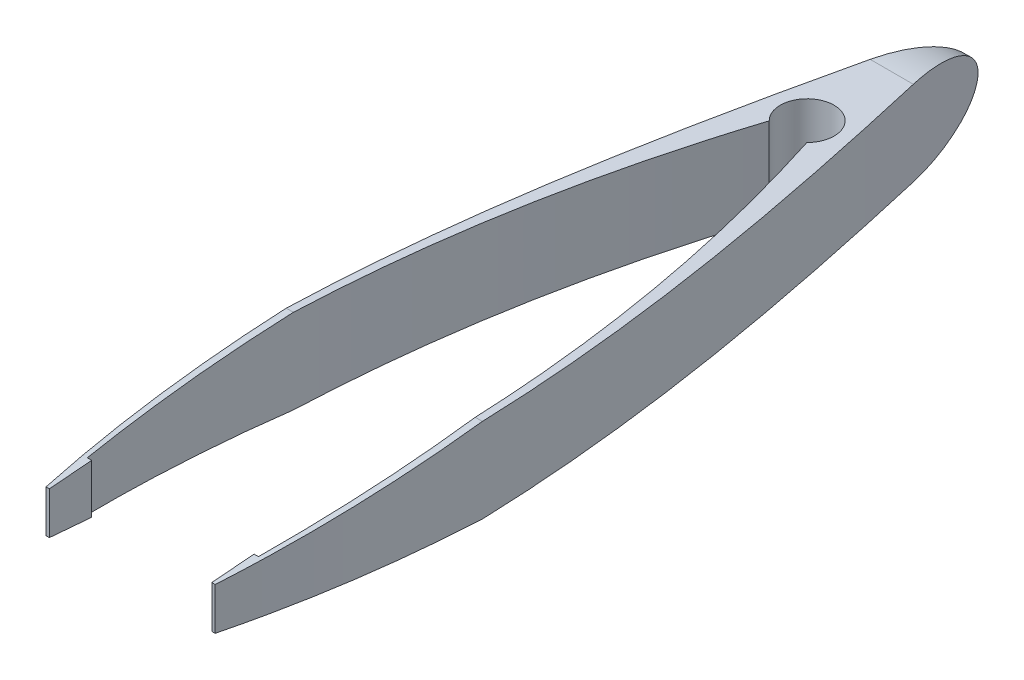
from build123d import *

# Parameters (mm, degrees)
BOSS_EXTRUDE1_DEPTH     = 5
BOSS_EXTRUDE3_START     = -5
BOSS_EXTRUDE3_DEPTH     = 10
CUT_EXTRUDE2_DEPTH      = 101.806228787
CUT_EXTRUDE2_DEPTH_BACK = 101.806228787
CUT_EXTRUDE3_DEPTH      = 101.806228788


with BuildPart() as part:
    # Sketch1 → Boss-Extrude1 (new, symmetric)
    with BuildSketch(Plane(origin=(0, 0, 0), x_dir=(1, 0, 0), z_dir=(0, 1, 0))):
        with BuildLine():
            Line((10, 0), (9.6, 0))
            add(Edge.make_bspline(
                [(9.6, 0), (14.30132674, 39.915658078), (2.226361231, 77.736387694)],
                knots=[0, 0, 0, 1, 1, 1], degree=2))
            ThreePointArc((2.226361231, 77.736387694), (0, 83.175), (-2.226361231, 77.736387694))
            add(Edge.make_bspline(
                [(-9.6, 0), (-14.30132674, 39.915658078), (-2.226361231, 77.736387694)],
                knots=[0, 0, 0, 1, 1, 1], degree=2))
            Line((-9.6, 0), (-10, 0))
            add(Edge.make_bspline(
                [(-0.2, 100), (-8.024632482, 67.341454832), (-15.036037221, 33.934023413), (-10, 0)],
                knots=[0, 0, 0, 0, 1, 1, 1, 1], degree=3))
            Line((-0.2, 100), (0.2, 100))
            add(Edge.make_bspline(
                [(0.2, 100), (8.024632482, 67.341454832), (15.036037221, 33.934023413), (10, 0)],
                knots=[0, 0, 0, 0, 1, 1, 1, 1], degree=3))
        make_face()
    extrude(amount=BOSS_EXTRUDE1_DEPTH, both=True)

    # Sketch6 → Boss-Extrude3 (add)
    with BuildSketch(Plane(origin=(0, 0, 0), x_dir=(1, 0, 0), z_dir=(0, 1, 0)).offset(BOSS_EXTRUDE3_START)):
        with BuildLine():
            Line((-9.6, 0), (-9.6, 5))
            Line((-9.6, 5), (-10.123851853, 5))
            add(Edge.make_bspline(
                [(-9.6, 0), (-9.894939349, 2.504122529), (-10.123851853, 5)],
                knots=[0, 0, 0, 1, 1, 1], degree=2))
        make_face()
        with BuildLine():
            Line((9.6, 0), (9.6, 5))
            Line((9.6, 5), (10.123851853, 5))
            add(Edge.make_bspline(
                [(10.123851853, 5), (9.894939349, 2.504122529), (9.6, 0)],
                knots=[0, 0, 0, 1, 1, 1], degree=2))
        make_face()
    extrude(amount=BOSS_EXTRUDE3_DEPTH)

    # Sketch3 → Cut-Extrude2 (cut, two sides: drawn at the far end of the back side and taken through both)
    with BuildSketch(Plane(origin=(0, 0, 0), x_dir=(0, 0, -1), z_dir=(1, 0, 0)).offset(-CUT_EXTRUDE2_DEPTH_BACK)):
        Polygon((0, -2.5), (30, -5), (0, -5), align=None)
        Polygon((30, 5), (0, 5), (0, 2.5), align=None)
    extrude(amount=CUT_EXTRUDE2_DEPTH + CUT_EXTRUDE2_DEPTH_BACK, mode=Mode.SUBTRACT)

    # Sketch7 → Cut-Extrude3 (cut, symmetric)
    with BuildSketch(Plane(origin=(0, 0, 0), x_dir=(0, 0, -1), z_dir=(1, 0, 0))):
        with BuildLine():
            Line((100, 5), (90, 5))
            add(Edge.make_bspline(
                [(100, 0), (100, 5), (90, 5)],
                knots=[3.141592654, 3.141592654, 3.141592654, 4.71238898, 4.71238898, 4.71238898], degree=2, weights=[1, 0.707106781, 1]))
            Line((100, 0), (100, 5))
        make_face()
    cut_extrude3 = extrude(amount=CUT_EXTRUDE3_DEPTH, both=True, mode=Mode.SUBTRACT)

    # Mirror3: Cut-Extrude3 across plane
    add(cut_extrude3.mirror(Plane.ZX), mode=Mode.SUBTRACT)


solid = part.part
